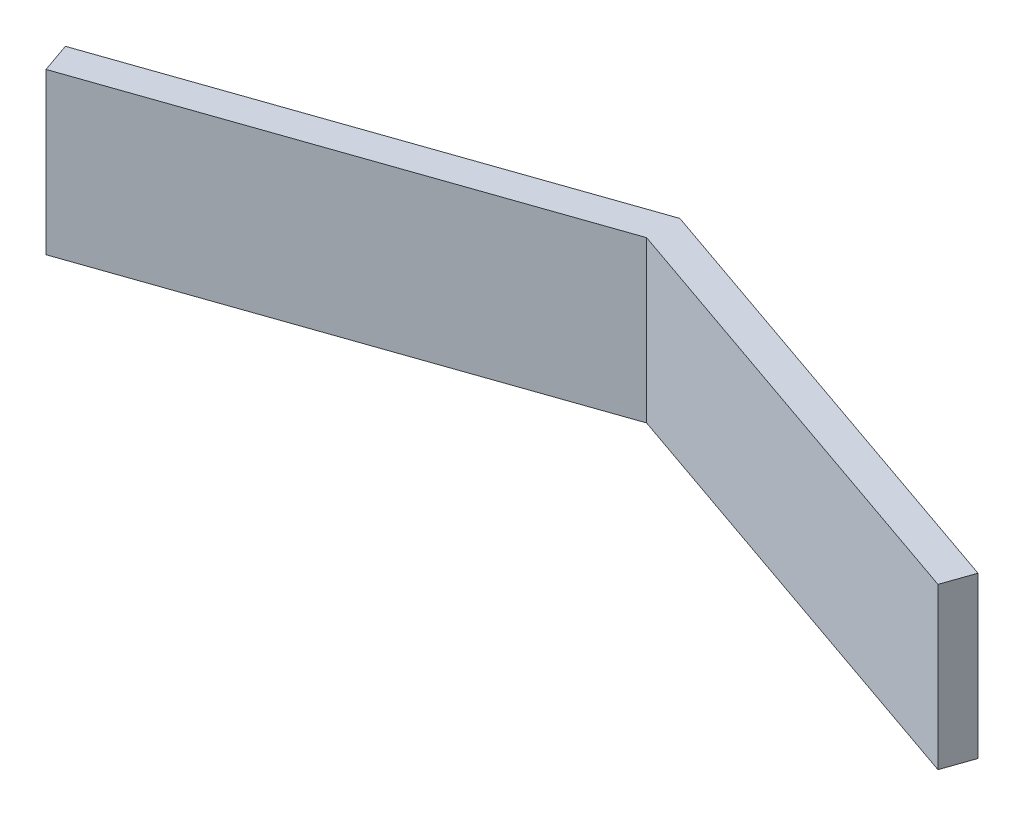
ISO-10303-21;
HEADER;
FILE_DESCRIPTION(('STEP AP214'),'2;1');
FILE_NAME('part.step','',(''),(''),'','','');
FILE_SCHEMA(('AUTOMOTIVE_DESIGN { 1 0 10303 214 1 1 1 1 }'));
ENDSEC;
DATA;
#1=APPLICATION_CONTEXT('core data for automotive mechanical design processes');
#2=APPLICATION_PROTOCOL_DEFINITION('international standard','automotive_design',2000,#1);
#3=PRODUCT_CONTEXT('',#1,'mechanical');
#4=PRODUCT('Part','Part','',(#3));
#5=PRODUCT_RELATED_PRODUCT_CATEGORY('part','',(#4));
#6=PRODUCT_DEFINITION_FORMATION('','',#4);
#7=PRODUCT_DEFINITION_CONTEXT('part definition',#1,'design');
#8=PRODUCT_DEFINITION('design','',#6,#7);
#9=PRODUCT_DEFINITION_SHAPE('','',#8);
#10=(LENGTH_UNIT() NAMED_UNIT(*) SI_UNIT(.MILLI.,.METRE.));
#11=(NAMED_UNIT(*) PLANE_ANGLE_UNIT() SI_UNIT($,.RADIAN.));
#12=(NAMED_UNIT(*) SI_UNIT($,.STERADIAN.) SOLID_ANGLE_UNIT());
#13=UNCERTAINTY_MEASURE_WITH_UNIT(LENGTH_MEASURE(1.E-05),#10,'distance_accuracy_value','');
#14=(GEOMETRIC_REPRESENTATION_CONTEXT(3) GLOBAL_UNCERTAINTY_ASSIGNED_CONTEXT((#13)) GLOBAL_UNIT_ASSIGNED_CONTEXT((#10,
#11,#12)) REPRESENTATION_CONTEXT('',''));
#15=CARTESIAN_POINT('',(0.,0.,0.));
#16=DIRECTION('',(0.,0.,1.));
#17=DIRECTION('',(1.,0.,0.));
#18=AXIS2_PLACEMENT_3D('',#15,#16,#17);
#19=CARTESIAN_POINT('',(-141.725429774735,25.5,0.));
#20=DIRECTION('',(0.944836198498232,0.,-0.327543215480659));
#21=DIRECTION('',(-0.327543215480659,0.,-0.944836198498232));
#22=AXIS2_PLACEMENT_3D('',#19,#20,#21);
#23=PLANE('',#22);
#24=DIRECTION('',(0.327543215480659,0.,0.944836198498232));
#25=VECTOR('',#24,1.);
#26=CARTESIAN_POINT('',(-141.725429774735,-25.5,0.));
#27=LINE('',#26,#25);
#28=CARTESIAN_POINT('',(-145.000861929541,-25.5,-9.4483619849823));
#29=VERTEX_POINT('',#28);
#30=CARTESIAN_POINT('',(-141.725429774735,-25.5,0.));
#31=VERTEX_POINT('',#30);
#32=EDGE_CURVE('E118',#29,#31,#27,.T.);
#33=ORIENTED_EDGE('',*,*,#32,.T.);
#34=DIRECTION('',(0.,-1.,0.));
#35=VECTOR('',#34,1.);
#36=CARTESIAN_POINT('',(-141.725429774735,25.5,0.));
#37=LINE('',#36,#35);
#38=CARTESIAN_POINT('',(-141.725429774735,25.5,0.));
#39=VERTEX_POINT('',#38);
#40=EDGE_CURVE('E11',#39,#31,#37,.T.);
#41=ORIENTED_EDGE('',*,*,#40,.F.);
#42=DIRECTION('',(0.327543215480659,0.,0.944836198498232));
#43=VECTOR('',#42,1.);
#44=CARTESIAN_POINT('',(-141.725429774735,25.5,0.));
#45=LINE('',#44,#43);
#46=CARTESIAN_POINT('',(-145.000861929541,25.5,-9.4483619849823));
#47=VERTEX_POINT('',#46);
#48=EDGE_CURVE('E128',#47,#39,#45,.T.);
#49=ORIENTED_EDGE('',*,*,#48,.F.);
#50=DIRECTION('',(0.,-1.,0.));
#51=VECTOR('',#50,1.);
#52=CARTESIAN_POINT('',(-145.000861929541,25.5,-9.4483619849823));
#53=LINE('',#52,#51);
#54=EDGE_CURVE('E114',#47,#29,#53,.T.);
#55=ORIENTED_EDGE('',*,*,#54,.T.);
#56=EDGE_LOOP('',(#33,#41,#49,#55));
#57=FACE_BOUND('',#56,.T.);
#58=ADVANCED_FACE('F34',(#57),#23,.F.);
#59=CARTESIAN_POINT('',(-141.725429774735,25.5,0.));
#60=DIRECTION('',(-0.327543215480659,0.,-0.944836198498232));
#61=DIRECTION('',(-0.944836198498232,0.,0.327543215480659));
#62=AXIS2_PLACEMENT_3D('',#59,#60,#61);
#63=PLANE('',#62);
#64=DIRECTION('',(0.944836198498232,0.,-0.327543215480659));
#65=VECTOR('',#64,1.);
#66=CARTESIAN_POINT('',(-141.725429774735,-25.5,0.));
#67=LINE('',#66,#65);
#68=CARTESIAN_POINT('',(0.,-25.5,-49.1314823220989));
#69=VERTEX_POINT('',#68);
#70=EDGE_CURVE('E121',#31,#69,#67,.T.);
#71=ORIENTED_EDGE('',*,*,#70,.T.);
#72=DIRECTION('',(0.,-1.,0.));
#73=VECTOR('',#72,1.);
#74=CARTESIAN_POINT('',(0.,25.5,-49.1314823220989));
#75=LINE('',#74,#73);
#76=CARTESIAN_POINT('',(0.,25.5,-49.1314823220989));
#77=VERTEX_POINT('',#76);
#78=EDGE_CURVE('E42',#77,#69,#75,.T.);
#79=ORIENTED_EDGE('',*,*,#78,.F.);
#80=DIRECTION('',(0.944836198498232,0.,-0.327543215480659));
#81=VECTOR('',#80,1.);
#82=CARTESIAN_POINT('',(-141.725429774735,25.5,0.));
#83=LINE('',#82,#81);
#84=EDGE_CURVE('E87',#39,#77,#83,.T.);
#85=ORIENTED_EDGE('',*,*,#84,.F.);
#86=ORIENTED_EDGE('',*,*,#40,.T.);
#87=EDGE_LOOP('',(#71,#79,#85,#86));
#88=FACE_BOUND('',#87,.T.);
#89=ADVANCED_FACE('F152',(#88),#63,.F.);
#90=CARTESIAN_POINT('',(141.725429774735,25.5,0.));
#91=DIRECTION('',(0.327543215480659,0.,-0.944836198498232));
#92=DIRECTION('',(-0.944836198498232,0.,-0.327543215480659));
#93=AXIS2_PLACEMENT_3D('',#90,#91,#92);
#94=PLANE('',#93);
#95=DIRECTION('',(0.944836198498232,0.,0.327543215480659));
#96=VECTOR('',#95,1.);
#97=CARTESIAN_POINT('',(141.725429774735,-25.5,0.));
#98=LINE('',#97,#96);
#99=CARTESIAN_POINT('',(141.725429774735,-25.5,0.));
#100=VERTEX_POINT('',#99);
#101=EDGE_CURVE('E123',#69,#100,#98,.T.);
#102=ORIENTED_EDGE('',*,*,#101,.T.);
#103=DIRECTION('',(0.,-1.,0.));
#104=VECTOR('',#103,1.);
#105=CARTESIAN_POINT('',(141.725429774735,25.5,0.));
#106=LINE('',#105,#104);
#107=CARTESIAN_POINT('',(141.725429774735,25.5,0.));
#108=VERTEX_POINT('',#107);
#109=EDGE_CURVE('E109',#108,#100,#106,.T.);
#110=ORIENTED_EDGE('',*,*,#109,.F.);
#111=DIRECTION('',(0.944836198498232,0.,0.327543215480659));
#112=VECTOR('',#111,1.);
#113=CARTESIAN_POINT('',(141.725429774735,25.5,0.));
#114=LINE('',#113,#112);
#115=EDGE_CURVE('E100',#77,#108,#114,.T.);
#116=ORIENTED_EDGE('',*,*,#115,.F.);
#117=ORIENTED_EDGE('',*,*,#78,.T.);
#118=EDGE_LOOP('',(#102,#110,#116,#117));
#119=FACE_BOUND('',#118,.T.);
#120=ADVANCED_FACE('F134',(#119),#94,.F.);
#121=CARTESIAN_POINT('',(141.725429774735,25.5,0.));
#122=DIRECTION('',(-0.944836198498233,0.,-0.327543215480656));
#123=DIRECTION('',(-0.327543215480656,0.,0.944836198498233));
#124=AXIS2_PLACEMENT_3D('',#121,#122,#123);
#125=PLANE('',#124);
#126=DIRECTION('',(0.327543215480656,0.,-0.944836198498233));
#127=VECTOR('',#126,1.);
#128=CARTESIAN_POINT('',(141.725429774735,-25.5,0.));
#129=LINE('',#128,#127);
#130=CARTESIAN_POINT('',(145.000861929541,-25.5,-9.4483619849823));
#131=VERTEX_POINT('',#130);
#132=EDGE_CURVE('E108',#100,#131,#129,.T.);
#133=ORIENTED_EDGE('',*,*,#132,.T.);
#134=DIRECTION('',(0.,-1.,0.));
#135=VECTOR('',#134,1.);
#136=CARTESIAN_POINT('',(145.000861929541,25.5,-9.4483619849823));
#137=LINE('',#136,#135);
#138=CARTESIAN_POINT('',(145.000861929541,25.5,-9.4483619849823));
#139=VERTEX_POINT('',#138);
#140=EDGE_CURVE('E105',#139,#131,#137,.T.);
#141=ORIENTED_EDGE('',*,*,#140,.F.);
#142=DIRECTION('',(0.327543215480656,0.,-0.944836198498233));
#143=VECTOR('',#142,1.);
#144=CARTESIAN_POINT('',(141.725429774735,25.5,0.));
#145=LINE('',#144,#143);
#146=EDGE_CURVE('E94',#108,#139,#145,.T.);
#147=ORIENTED_EDGE('',*,*,#146,.F.);
#148=ORIENTED_EDGE('',*,*,#109,.T.);
#149=EDGE_LOOP('',(#133,#141,#147,#148));
#150=FACE_BOUND('',#149,.T.);
#151=ADVANCED_FACE('F106',(#150),#125,.F.);
#152=CARTESIAN_POINT('',(0.,25.5,-59.7153274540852));
#153=DIRECTION('',(-0.32754321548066,0.,0.944836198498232));
#154=DIRECTION('',(0.944836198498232,0.,0.32754321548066));
#155=AXIS2_PLACEMENT_3D('',#152,#153,#154);
#156=PLANE('',#155);
#157=DIRECTION('',(-0.944836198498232,0.,-0.32754321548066));
#158=VECTOR('',#157,1.);
#159=CARTESIAN_POINT('',(0.,-25.5,-59.7153274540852));
#160=LINE('',#159,#158);
#161=CARTESIAN_POINT('',(0.,-25.5,-59.7153274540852));
#162=VERTEX_POINT('',#161);
#163=EDGE_CURVE('E73',#131,#162,#160,.T.);
#164=ORIENTED_EDGE('',*,*,#163,.T.);
#165=DIRECTION('',(0.,-1.,0.));
#166=VECTOR('',#165,1.);
#167=CARTESIAN_POINT('',(0.,25.5,-59.7153274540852));
#168=LINE('',#167,#166);
#169=CARTESIAN_POINT('',(0.,25.5,-59.7153274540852));
#170=VERTEX_POINT('',#169);
#171=EDGE_CURVE('E110',#170,#162,#168,.T.);
#172=ORIENTED_EDGE('',*,*,#171,.F.);
#173=DIRECTION('',(-0.944836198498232,0.,-0.32754321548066));
#174=VECTOR('',#173,1.);
#175=CARTESIAN_POINT('',(0.,25.5,-59.7153274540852));
#176=LINE('',#175,#174);
#177=EDGE_CURVE('E98',#139,#170,#176,.T.);
#178=ORIENTED_EDGE('',*,*,#177,.F.);
#179=ORIENTED_EDGE('',*,*,#140,.T.);
#180=EDGE_LOOP('',(#164,#172,#178,#179));
#181=FACE_BOUND('',#180,.T.);
#182=ADVANCED_FACE('F112',(#181),#156,.F.);
#183=CARTESIAN_POINT('',(0.,25.5,-59.7153274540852));
#184=DIRECTION('',(0.32754321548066,0.,0.944836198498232));
#185=DIRECTION('',(0.944836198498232,0.,-0.32754321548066));
#186=AXIS2_PLACEMENT_3D('',#183,#184,#185);
#187=PLANE('',#186);
#188=DIRECTION('',(-0.944836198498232,0.,0.32754321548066));
#189=VECTOR('',#188,1.);
#190=CARTESIAN_POINT('',(0.,-25.5,-59.7153274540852));
#191=LINE('',#190,#189);
#192=EDGE_CURVE('E79',#162,#29,#191,.T.);
#193=ORIENTED_EDGE('',*,*,#192,.T.);
#194=ORIENTED_EDGE('',*,*,#54,.F.);
#195=DIRECTION('',(-0.944836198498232,0.,0.32754321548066));
#196=VECTOR('',#195,1.);
#197=CARTESIAN_POINT('',(0.,25.5,-59.7153274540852));
#198=LINE('',#197,#196);
#199=EDGE_CURVE('E50',#170,#47,#198,.T.);
#200=ORIENTED_EDGE('',*,*,#199,.F.);
#201=ORIENTED_EDGE('',*,*,#171,.T.);
#202=EDGE_LOOP('',(#193,#194,#200,#201));
#203=FACE_BOUND('',#202,.T.);
#204=ADVANCED_FACE('F141',(#203),#187,.F.);
#205=CARTESIAN_POINT('',(0.,25.5,0.));
#206=DIRECTION('',(0.,1.,0.));
#207=DIRECTION('',(0.,0.,1.));
#208=AXIS2_PLACEMENT_3D('',#205,#206,#207);
#209=PLANE('',#208);
#210=ORIENTED_EDGE('',*,*,#48,.T.);
#211=ORIENTED_EDGE('',*,*,#84,.T.);
#212=ORIENTED_EDGE('',*,*,#115,.T.);
#213=ORIENTED_EDGE('',*,*,#146,.T.);
#214=ORIENTED_EDGE('',*,*,#177,.T.);
#215=ORIENTED_EDGE('',*,*,#199,.T.);
#216=EDGE_LOOP('',(#210,#211,#212,#213,#214,#215));
#217=FACE_BOUND('',#216,.T.);
#218=ADVANCED_FACE('F96',(#217),#209,.T.);
#219=CARTESIAN_POINT('',(0.,-25.5,0.));
#220=DIRECTION('',(0.,1.,0.));
#221=DIRECTION('',(0.,0.,1.));
#222=AXIS2_PLACEMENT_3D('',#219,#220,#221);
#223=PLANE('',#222);
#224=ORIENTED_EDGE('',*,*,#32,.F.);
#225=ORIENTED_EDGE('',*,*,#192,.F.);
#226=ORIENTED_EDGE('',*,*,#163,.F.);
#227=ORIENTED_EDGE('',*,*,#132,.F.);
#228=ORIENTED_EDGE('',*,*,#101,.F.);
#229=ORIENTED_EDGE('',*,*,#70,.F.);
#230=EDGE_LOOP('',(#224,#225,#226,#227,#228,#229));
#231=FACE_BOUND('',#230,.T.);
#232=ADVANCED_FACE('F137',(#231),#223,.F.);
#233=CLOSED_SHELL('',(#58,#89,#120,#151,#182,#204,#218,#232));
#234=MANIFOLD_SOLID_BREP('B2',#233);
#235=ADVANCED_BREP_SHAPE_REPRESENTATION('',(#18,#234),#14);
#236=SHAPE_DEFINITION_REPRESENTATION(#9,#235);
ENDSEC;
END-ISO-10303-21;
